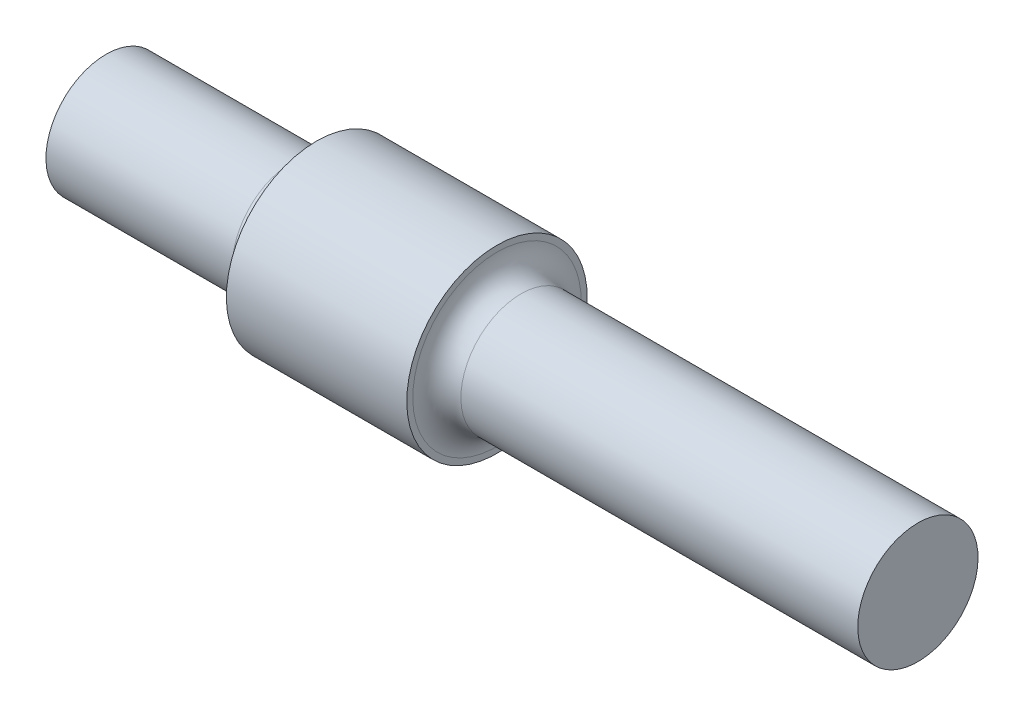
from build123d import *

# Parameters (mm, degrees)
FILLET1_R          = 4
CUT_EXTRUDE1_DEPTH = 2.5


with BuildPart() as part:
    # Sketch1 → Revolve1 (revolve)
    with BuildSketch(Plane.XY):
        Polygon((0, 15), (0, 25), (35, 25), (35, 30), (65, 30), (65, 25), (135, 25), (135, 15), align=None)
    revolve(axis=Axis((135, 15, 0), (-1, 0, 0)))

    # Fillet1
    fillet1_edges = [part.edges().sort_by_distance(p)[0] for p in [
        (65, 5, 0),
        (35, 5, 0),
    ]]
    fillet(fillet1_edges, radius=FILLET1_R)

    # Sketch2 → Cut-Extrude1 (cut)
    with BuildSketch(Plane(origin=(0, 0, 0), x_dir=(1, 0, 0), z_dir=(0, 1, 0))):
        with BuildLine():
            Line((57.5, 2.5), (42.5, 2.5))
            ThreePointArc((42.5, 2.5), (40, 0), (42.5, -2.5))
            Line((42.5, -2.5), (57.5, -2.5))
            ThreePointArc((57.5, -2.5), (60, 0), (57.5, 2.5))
        make_face()
    extrude(amount=CUT_EXTRUDE1_DEPTH, mode=Mode.SUBTRACT)


solid = part.part
